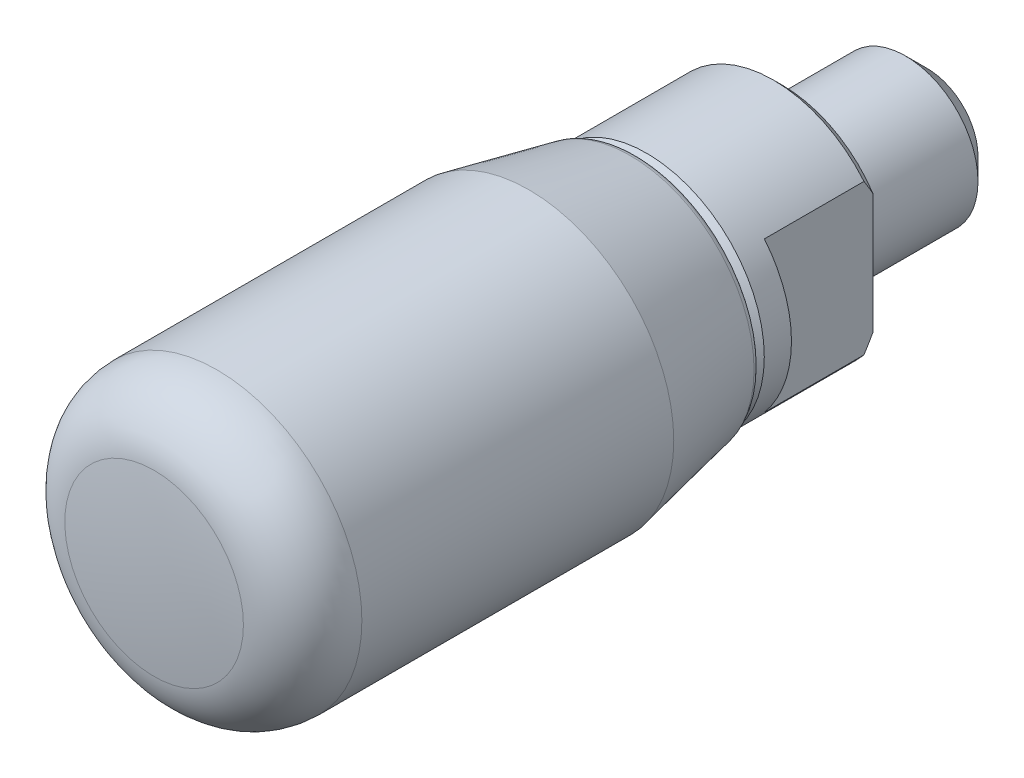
ISO-10303-21;
HEADER;
FILE_DESCRIPTION(('STEP AP214'),'2;1');
FILE_NAME('part.step','',(''),(''),'','','');
FILE_SCHEMA(('AUTOMOTIVE_DESIGN { 1 0 10303 214 1 1 1 1 }'));
ENDSEC;
DATA;
#1=APPLICATION_CONTEXT('core data for automotive mechanical design processes');
#2=APPLICATION_PROTOCOL_DEFINITION('international standard','automotive_design',2000,#1);
#3=PRODUCT_CONTEXT('',#1,'mechanical');
#4=PRODUCT('Part','Part','',(#3));
#5=PRODUCT_RELATED_PRODUCT_CATEGORY('part','',(#4));
#6=PRODUCT_DEFINITION_FORMATION('','',#4);
#7=PRODUCT_DEFINITION_CONTEXT('part definition',#1,'design');
#8=PRODUCT_DEFINITION('design','',#6,#7);
#9=PRODUCT_DEFINITION_SHAPE('','',#8);
#10=(LENGTH_UNIT() NAMED_UNIT(*) SI_UNIT(.MILLI.,.METRE.));
#11=(NAMED_UNIT(*) PLANE_ANGLE_UNIT() SI_UNIT($,.RADIAN.));
#12=(NAMED_UNIT(*) SI_UNIT($,.STERADIAN.) SOLID_ANGLE_UNIT());
#13=UNCERTAINTY_MEASURE_WITH_UNIT(LENGTH_MEASURE(1.E-05),#10,'distance_accuracy_value','');
#14=(GEOMETRIC_REPRESENTATION_CONTEXT(3) GLOBAL_UNCERTAINTY_ASSIGNED_CONTEXT((#13)) GLOBAL_UNIT_ASSIGNED_CONTEXT((#10,
#11,#12)) REPRESENTATION_CONTEXT('',''));
#15=CARTESIAN_POINT('',(0.,0.,0.));
#16=DIRECTION('',(0.,0.,1.));
#17=DIRECTION('',(1.,0.,0.));
#18=AXIS2_PLACEMENT_3D('',#15,#16,#17);
#19=CARTESIAN_POINT('',(0.,6.,0.));
#20=DIRECTION('',(0.,0.,1.));
#21=DIRECTION('',(1.,0.,0.));
#22=AXIS2_PLACEMENT_3D('',#19,#20,#21);
#23=PLANE('',#22);
#24=CARTESIAN_POINT('',(0.,0.,0.));
#25=DIRECTION('',(0.,0.,1.));
#26=DIRECTION('',(1.,0.,0.));
#27=AXIS2_PLACEMENT_3D('',#24,#25,#26);
#28=CIRCLE('',#27,4.);
#29=CARTESIAN_POINT('',(4.,0.,0.));
#30=VERTEX_POINT('',#29);
#31=EDGE_CURVE('E202',#30,#30,#28,.T.);
#32=ORIENTED_EDGE('',*,*,#31,.T.);
#33=EDGE_LOOP('',(#32));
#34=FACE_BOUND('',#33,.T.);
#35=DIRECTION('',(0.,1.,0.));
#36=VECTOR('',#35,1.);
#37=CARTESIAN_POINT('',(-5.,4.15,0.));
#38=LINE('',#37,#36);
#39=CARTESIAN_POINT('',(-5.,-3.31662479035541,0.));
#40=VERTEX_POINT('',#39);
#41=CARTESIAN_POINT('',(-5.,3.31662479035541,0.));
#42=VERTEX_POINT('',#41);
#43=EDGE_CURVE('E110',#40,#42,#38,.T.);
#44=ORIENTED_EDGE('',*,*,#43,.T.);
#45=CARTESIAN_POINT('',(0.,0.,0.));
#46=DIRECTION('',(0.,0.,1.));
#47=DIRECTION('',(1.,0.,0.));
#48=AXIS2_PLACEMENT_3D('',#45,#46,#47);
#49=CIRCLE('',#48,6.);
#50=CARTESIAN_POINT('',(5.,3.31662479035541,0.));
#51=VERTEX_POINT('',#50);
#52=EDGE_CURVE('E199',#51,#42,#49,.T.);
#53=ORIENTED_EDGE('',*,*,#52,.F.);
#54=DIRECTION('',(0.,1.,0.));
#55=VECTOR('',#54,1.);
#56=CARTESIAN_POINT('',(5.,4.15,0.));
#57=LINE('',#56,#55);
#58=CARTESIAN_POINT('',(5.,-3.31662479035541,0.));
#59=VERTEX_POINT('',#58);
#60=EDGE_CURVE('E227',#59,#51,#57,.T.);
#61=ORIENTED_EDGE('',*,*,#60,.F.);
#62=EDGE_CURVE('E193',#40,#59,#49,.T.);
#63=ORIENTED_EDGE('',*,*,#62,.F.);
#64=EDGE_LOOP('',(#44,#53,#61,#63));
#65=FACE_BOUND('',#64,.T.);
#66=ADVANCED_FACE('F14',(#34,#65),#23,.F.);
#67=CARTESIAN_POINT('',(0.,0.,0.));
#68=DIRECTION('',(0.,0.,1.));
#69=DIRECTION('',(1.,0.,0.));
#70=AXIS2_PLACEMENT_3D('',#67,#68,#69);
#71=CONICAL_SURFACE('',#70,6.,0.785398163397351);
#72=CARTESIAN_POINT('',(-7.37772942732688,4.15,2.4648326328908));
#73=CARTESIAN_POINT('',(-7.18321832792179,4.15,2.29534660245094));
#74=CARTESIAN_POINT('',(-6.98794508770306,4.15,2.12672189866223));
#75=CARTESIAN_POINT('',(-6.59545015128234,4.15,1.79177759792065));
#76=CARTESIAN_POINT('',(-6.39822855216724,4.15,1.62545788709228));
#77=CARTESIAN_POINT('',(-6.00201932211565,4.15,1.29620914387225));
#78=CARTESIAN_POINT('',(-5.80303922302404,4.15,1.13327107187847));
#79=CARTESIAN_POINT('',(-5.40206848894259,4.15,0.811062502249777));
#80=CARTESIAN_POINT('',(-5.20007737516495,4.15,0.651792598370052));
#81=CARTESIAN_POINT('',(-4.7916623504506,4.15,0.337620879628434));
#82=CARTESIAN_POINT('',(-4.58522611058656,4.15,0.182735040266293));
#83=CARTESIAN_POINT('',(-4.1675783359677,4.15,-0.120331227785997));
#84=CARTESIAN_POINT('',(-3.95636892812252,4.15,-0.26851455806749));
#85=CARTESIAN_POINT('',(-3.63451470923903,4.15,-0.484035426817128));
#86=CARTESIAN_POINT('',(-3.52620615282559,4.15,-0.55486183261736));
#87=CARTESIAN_POINT('',(-3.30780423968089,4.15,-0.693687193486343));
#88=CARTESIAN_POINT('',(-3.19771109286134,4.15,-0.761686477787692));
#89=CARTESIAN_POINT('',(-2.97533317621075,4.15,-0.894403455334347));
#90=CARTESIAN_POINT('',(-2.86304543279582,4.15,-0.959116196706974));
#91=CARTESIAN_POINT('',(-2.63614165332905,4.15,-1.08442566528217));
#92=CARTESIAN_POINT('',(-2.52152468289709,4.15,-1.14502069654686));
#93=CARTESIAN_POINT('',(-2.40564219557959,4.15,-1.20316621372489));
#94=B_SPLINE_CURVE_WITH_KNOTS('',3,(#72,#73,#74,#75,#76,#77,#78,#79,#80,#81,#82,#83,#84,#85,#86,
#87,#88,#89,#90,#91,#92,#93),.UNSPECIFIED.,.F.,.F.,(4,2,2,2,2,2,2,2,2,2,4),(0.,
0.773987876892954,1.54793737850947,2.31944587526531,3.09107838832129,3.86523254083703,
4.6390482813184,5.02724568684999,5.4153977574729,5.80411829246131,6.1929979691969),.UNSPECIFIED.);
#95=CARTESIAN_POINT('',(-5.00274924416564,4.14999999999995,0.5));
#96=VERTEX_POINT('',#95);
#97=CARTESIAN_POINT('',(-5.,4.15,0.497884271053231));
#98=VERTEX_POINT('',#97);
#99=EDGE_CURVE('E105',#96,#98,#94,.T.);
#100=ORIENTED_EDGE('',*,*,#99,.F.);
#101=CARTESIAN_POINT('',(0.,0.,0.5));
#102=DIRECTION('',(0.,0.,1.));
#103=DIRECTION('',(1.,0.,0.));
#104=AXIS2_PLACEMENT_3D('',#101,#102,#103);
#105=CIRCLE('',#104,6.49999999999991);
#106=CARTESIAN_POINT('',(5.00274924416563,4.15,0.5));
#107=VERTEX_POINT('',#106);
#108=EDGE_CURVE('E189',#107,#96,#105,.T.);
#109=ORIENTED_EDGE('',*,*,#108,.F.);
#110=CARTESIAN_POINT('',(7.37772942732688,4.15,2.4648326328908));
#111=CARTESIAN_POINT('',(7.18321832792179,4.15,2.29534660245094));
#112=CARTESIAN_POINT('',(6.98794508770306,4.15,2.12672189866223));
#113=CARTESIAN_POINT('',(6.59545015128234,4.15,1.79177759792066));
#114=CARTESIAN_POINT('',(6.39822855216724,4.15,1.62545788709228));
#115=CARTESIAN_POINT('',(6.00201932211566,4.15,1.29620914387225));
#116=CARTESIAN_POINT('',(5.80303922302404,4.15,1.13327107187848));
#117=CARTESIAN_POINT('',(5.40206848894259,4.15,0.811062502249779));
#118=CARTESIAN_POINT('',(5.20007737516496,4.15,0.651792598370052));
#119=CARTESIAN_POINT('',(4.79166235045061,4.15,0.337620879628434));
#120=CARTESIAN_POINT('',(4.58522611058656,4.15,0.182735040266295));
#121=CARTESIAN_POINT('',(4.1675783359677,4.15,-0.120331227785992));
#122=CARTESIAN_POINT('',(3.95636892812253,4.15,-0.268514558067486));
#123=CARTESIAN_POINT('',(3.63451470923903,4.15,-0.484035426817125));
#124=CARTESIAN_POINT('',(3.5262061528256,4.15,-0.554861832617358));
#125=CARTESIAN_POINT('',(3.30780423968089,4.15,-0.693687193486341));
#126=CARTESIAN_POINT('',(3.19771109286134,4.15,-0.761686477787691));
#127=CARTESIAN_POINT('',(2.97533317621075,4.15,-0.894403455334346));
#128=CARTESIAN_POINT('',(2.86304543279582,4.15,-0.959116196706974));
#129=CARTESIAN_POINT('',(2.63614165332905,4.15,-1.08442566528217));
#130=CARTESIAN_POINT('',(2.52152468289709,4.15,-1.14502069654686));
#131=CARTESIAN_POINT('',(2.40564219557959,4.15,-1.20316621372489));
#132=B_SPLINE_CURVE_WITH_KNOTS('',3,(#110,#111,#112,#113,#114,#115,#116,#117,#118,#119,#120,
#121,#122,#123,#124,#125,#126,#127,#128,#129,#130,#131),.UNSPECIFIED.,.F.,.F.,(4,2,2,2,2,2,2,2,
2,2,4),(0.,0.773987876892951,1.54793737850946,2.31944587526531,3.09107838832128,
3.86523254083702,4.6390482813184,5.02724568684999,5.4153977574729,5.80411829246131,
6.1929979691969),.UNSPECIFIED.);
#133=CARTESIAN_POINT('',(5.,4.15,0.497884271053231));
#134=VERTEX_POINT('',#133);
#135=EDGE_CURVE('E235',#107,#134,#132,.T.);
#136=ORIENTED_EDGE('',*,*,#135,.T.);
#137=CARTESIAN_POINT('',(5.,-9.13922796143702,4.4175567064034));
#138=CARTESIAN_POINT('',(5.,-9.00516778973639,4.29994970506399));
#139=CARTESIAN_POINT('',(5.,-8.87081524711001,4.182676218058));
#140=CARTESIAN_POINT('',(5.,-8.60144693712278,3.94888968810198));
#141=CARTESIAN_POINT('',(5.,-8.46643116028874,3.83237665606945));
#142=CARTESIAN_POINT('',(5.,-8.06016128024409,3.48402416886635));
#143=CARTESIAN_POINT('',(5.,-7.78779910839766,3.25347203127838));
#144=CARTESIAN_POINT('',(5.,-7.23394785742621,2.79238268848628));
#145=CARTESIAN_POINT('',(5.,-6.95238454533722,2.56193448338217));
#146=CARTESIAN_POINT('',(5.,-6.38426038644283,2.10738158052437));
#147=CARTESIAN_POINT('',(5.,-6.09770077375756,1.88327535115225));
#148=CARTESIAN_POINT('',(5.,-5.66269261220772,1.55362141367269));
#149=CARTESIAN_POINT('',(5.,-5.51675073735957,1.44476576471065));
#150=CARTESIAN_POINT('',(5.,-5.22291949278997,1.22971946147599));
#151=CARTESIAN_POINT('',(5.,-5.07503019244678,1.12352871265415));
#152=CARTESIAN_POINT('',(5.,-4.77685975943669,0.914267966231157));
#153=CARTESIAN_POINT('',(5.,-4.62657663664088,0.811200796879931));
#154=CARTESIAN_POINT('',(5.,-4.32339131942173,0.609005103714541));
#155=CARTESIAN_POINT('',(5.,-4.17048932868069,0.509876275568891));
#156=CARTESIAN_POINT('',(5.,-3.86251683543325,0.31701686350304));
#157=CARTESIAN_POINT('',(5.,-3.70746366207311,0.223258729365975));
#158=CARTESIAN_POINT('',(5.,-3.39386923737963,0.0416884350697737));
#159=CARTESIAN_POINT('',(5.,-3.23532756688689,-0.0461230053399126));
#160=CARTESIAN_POINT('',(5.,-2.9145276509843,-0.214170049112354));
#161=CARTESIAN_POINT('',(5.,-2.75227483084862,-0.294415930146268));
#162=CARTESIAN_POINT('',(5.,-2.42349610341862,-0.445539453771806));
#163=CARTESIAN_POINT('',(5.,-2.25697182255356,-0.516420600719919));
#164=CARTESIAN_POINT('',(5.,-1.91542594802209,-0.648041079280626));
#165=CARTESIAN_POINT('',(5.,-1.74029673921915,-0.708505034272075));
#166=CARTESIAN_POINT('',(5.,-1.38549006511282,-0.814351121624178));
#167=CARTESIAN_POINT('',(5.,-1.20581331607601,-0.859735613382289));
#168=CARTESIAN_POINT('',(5.,-0.844187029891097,-0.932301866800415));
#169=CARTESIAN_POINT('',(5.,-0.662265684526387,-0.959621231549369));
#170=CARTESIAN_POINT('',(5.,-0.296527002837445,-0.994519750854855));
#171=CARTESIAN_POINT('',(5.,-0.112710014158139,-1.00210246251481));
#172=CARTESIAN_POINT('',(5.,0.25542297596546,-0.99687927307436));
#173=CARTESIAN_POINT('',(5.,0.439737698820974,-0.983985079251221));
#174=CARTESIAN_POINT('',(5.,0.805945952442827,-0.938727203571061));
#175=CARTESIAN_POINT('',(5.,0.987838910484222,-0.906358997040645));
#176=CARTESIAN_POINT('',(5.,1.34914197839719,-0.824197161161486));
#177=CARTESIAN_POINT('',(5.,1.5285193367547,-0.774262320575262));
#178=CARTESIAN_POINT('',(5.,1.88254992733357,-0.659972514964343));
#179=CARTESIAN_POINT('',(5.,2.05720286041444,-0.595616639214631));
#180=CARTESIAN_POINT('',(5.,2.42894177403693,-0.444234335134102));
#181=CARTESIAN_POINT('',(5.,2.62521500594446,-0.355232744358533));
#182=CARTESIAN_POINT('',(5.,3.01196152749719,-0.165317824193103));
#183=CARTESIAN_POINT('',(5.,3.20243151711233,-0.0643978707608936));
#184=CARTESIAN_POINT('',(5.,3.57861118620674,0.146721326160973));
#185=CARTESIAN_POINT('',(5.,3.76431067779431,0.256938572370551));
#186=CARTESIAN_POINT('',(5.,4.13130160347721,0.48436015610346));
#187=CARTESIAN_POINT('',(5.,4.31259387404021,0.601563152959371));
#188=CARTESIAN_POINT('',(5.,4.6725112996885,0.842101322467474));
#189=CARTESIAN_POINT('',(5.,4.85111593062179,0.965467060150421));
#190=CARTESIAN_POINT('',(5.,5.20522704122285,1.2165650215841));
#191=CARTESIAN_POINT('',(5.,5.38073340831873,1.34429740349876));
#192=CARTESIAN_POINT('',(5.,5.72894509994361,1.60310894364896));
#193=CARTESIAN_POINT('',(5.,5.90165337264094,1.73418414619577));
#194=CARTESIAN_POINT('',(5.,6.24487651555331,1.99916223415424));
#195=CARTESIAN_POINT('',(5.,6.4153914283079,2.13306506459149));
#196=CARTESIAN_POINT('',(5.,6.80406275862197,2.44261177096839));
#197=CARTESIAN_POINT('',(5.,7.02159975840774,2.61903258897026));
#198=CARTESIAN_POINT('',(5.,7.45420128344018,2.97496683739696));
#199=CARTESIAN_POINT('',(5.,7.66926526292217,3.15448092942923));
#200=CARTESIAN_POINT('',(5.,8.09444606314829,3.51352896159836));
#201=CARTESIAN_POINT('',(5.,8.30459052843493,3.69303022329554));
#202=CARTESIAN_POINT('',(5.,8.72312762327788,4.05394892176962));
#203=CARTESIAN_POINT('',(5.,8.93152071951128,4.23536581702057));
#204=CARTESIAN_POINT('',(5.,9.13922796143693,4.4175567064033));
#205=B_SPLINE_CURVE_WITH_KNOTS('',3,(#137,#138,#139,#140,#141,#142,#143,#144,#145,#146,#147,
#148,#149,#150,#151,#152,#153,#154,#155,#156,#157,#158,#159,#160,#161,#162,#163,#164,#165,#166,
#167,#168,#169,#170,#171,#172,#173,#174,#175,#176,#177,#178,#179,#180,#181,#182,#183,#184,#185,
#186,#187,#188,#189,#190,#191,#192,#193,#194,#195,#196,#197,#198,#199,#200,#201,#202,#203,#204),
.UNSPECIFIED.,.F.,.F.,(4,2,2,2,2,2,2,2,2,2,2,2,2,2,2,2,2,2,2,2,2,2,2,2,2,2,2,2,2,2,2,2,2,4),(0.,
0.535005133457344,1.07001793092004,2.14050091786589,3.23198174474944,4.32319668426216,
4.86937586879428,5.41553564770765,5.96217600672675,6.50877404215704,7.05225635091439,
7.59580432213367,8.13860292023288,8.68119782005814,9.23645905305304,9.79163336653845,
10.3425286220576,10.8933245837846,11.4465019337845,11.999807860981,12.5576672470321,
13.1155618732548,13.761555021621,14.4079089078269,15.0555444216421,15.7030560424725,
16.3541803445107,17.0053282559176,17.6557384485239,18.3061360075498,19.1463488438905,
19.9867436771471,20.8158461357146,21.6447201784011),.UNSPECIFIED.);
#206=EDGE_CURVE('E163',#51,#134,#205,.T.);
#207=ORIENTED_EDGE('',*,*,#206,.F.);
#208=ORIENTED_EDGE('',*,*,#52,.T.);
#209=CARTESIAN_POINT('',(-5.,9.13922796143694,4.4175567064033));
#210=CARTESIAN_POINT('',(-5.,9.0051677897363,4.2999497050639));
#211=CARTESIAN_POINT('',(-5.,8.87081524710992,4.18267621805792));
#212=CARTESIAN_POINT('',(-5.,8.60144693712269,3.9488896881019));
#213=CARTESIAN_POINT('',(-5.,8.46643116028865,3.83237665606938));
#214=CARTESIAN_POINT('',(-5.,8.06016128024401,3.48402416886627));
#215=CARTESIAN_POINT('',(-5.,7.78779910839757,3.2534720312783));
#216=CARTESIAN_POINT('',(-5.,7.23394785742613,2.79238268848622));
#217=CARTESIAN_POINT('',(-5.,6.95238454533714,2.5619344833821));
#218=CARTESIAN_POINT('',(-5.,6.38426038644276,2.10738158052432));
#219=CARTESIAN_POINT('',(-5.,6.09770077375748,1.8832753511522));
#220=CARTESIAN_POINT('',(-5.,5.66269261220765,1.55362141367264));
#221=CARTESIAN_POINT('',(-5.,5.51675073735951,1.4447657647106));
#222=CARTESIAN_POINT('',(-5.,5.2229194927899,1.22971946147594));
#223=CARTESIAN_POINT('',(-5.,5.07503019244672,1.1235287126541));
#224=CARTESIAN_POINT('',(-5.,4.77685975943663,0.914267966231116));
#225=CARTESIAN_POINT('',(-5.,4.62657663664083,0.811200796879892));
#226=CARTESIAN_POINT('',(-5.,4.32339131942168,0.609005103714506));
#227=CARTESIAN_POINT('',(-5.,4.17048932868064,0.509876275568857));
#228=CARTESIAN_POINT('',(-5.,3.8625168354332,0.317016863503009));
#229=CARTESIAN_POINT('',(-5.,3.70746366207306,0.223258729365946));
#230=CARTESIAN_POINT('',(-5.,3.39386923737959,0.0416884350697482));
#231=CARTESIAN_POINT('',(-5.,3.23532756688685,-0.0461230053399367));
#232=CARTESIAN_POINT('',(-5.,2.91452765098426,-0.214170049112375));
#233=CARTESIAN_POINT('',(-5.,2.75227483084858,-0.294415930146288));
#234=CARTESIAN_POINT('',(-5.,2.42349610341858,-0.445539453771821));
#235=CARTESIAN_POINT('',(-5.,2.25697182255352,-0.516420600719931));
#236=CARTESIAN_POINT('',(-5.,1.91542594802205,-0.648041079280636));
#237=CARTESIAN_POINT('',(-5.,1.74029673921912,-0.708505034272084));
#238=CARTESIAN_POINT('',(-5.,1.38549006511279,-0.814351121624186));
#239=CARTESIAN_POINT('',(-5.,1.20581331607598,-0.859735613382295));
#240=CARTESIAN_POINT('',(-5.,0.844187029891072,-0.932301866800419));
#241=CARTESIAN_POINT('',(-5.,0.662265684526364,-0.959621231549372));
#242=CARTESIAN_POINT('',(-5.,0.296527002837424,-0.994519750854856));
#243=CARTESIAN_POINT('',(-5.,0.112710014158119,-1.00210246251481));
#244=CARTESIAN_POINT('',(-5.,-0.255422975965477,-0.996879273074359));
#245=CARTESIAN_POINT('',(-5.,-0.439737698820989,-0.98398507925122));
#246=CARTESIAN_POINT('',(-5.,-0.805945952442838,-0.938727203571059));
#247=CARTESIAN_POINT('',(-5.,-0.987838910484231,-0.906358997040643));
#248=CARTESIAN_POINT('',(-5.,-1.34914197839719,-0.824197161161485));
#249=CARTESIAN_POINT('',(-5.,-1.5285193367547,-0.774262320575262));
#250=CARTESIAN_POINT('',(-5.,-1.88254992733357,-0.659972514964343));
#251=CARTESIAN_POINT('',(-5.,-2.05720286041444,-0.59561663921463));
#252=CARTESIAN_POINT('',(-5.,-2.42894177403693,-0.444234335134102));
#253=CARTESIAN_POINT('',(-5.,-2.62521500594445,-0.355232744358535));
#254=CARTESIAN_POINT('',(-5.,-3.01196152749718,-0.165317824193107));
#255=CARTESIAN_POINT('',(-5.,-3.20243151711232,-0.0643978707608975));
#256=CARTESIAN_POINT('',(-5.,-3.57861118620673,0.146721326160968));
#257=CARTESIAN_POINT('',(-5.,-3.7643106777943,0.256938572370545));
#258=CARTESIAN_POINT('',(-5.,-4.1313016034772,0.484360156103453));
#259=CARTESIAN_POINT('',(-5.,-4.3125938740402,0.601563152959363));
#260=CARTESIAN_POINT('',(-5.,-4.67251129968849,0.842101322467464));
#261=CARTESIAN_POINT('',(-5.,-4.85111593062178,0.965467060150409));
#262=CARTESIAN_POINT('',(-5.,-5.20522704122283,1.21656502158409));
#263=CARTESIAN_POINT('',(-5.,-5.38073340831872,1.34429740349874));
#264=CARTESIAN_POINT('',(-5.,-5.72894509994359,1.60310894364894));
#265=CARTESIAN_POINT('',(-5.,-5.90165337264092,1.73418414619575));
#266=CARTESIAN_POINT('',(-5.,-6.24487651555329,1.99916223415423));
#267=CARTESIAN_POINT('',(-5.,-6.41539142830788,2.13306506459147));
#268=CARTESIAN_POINT('',(-5.,-6.80406275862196,2.44261177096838));
#269=CARTESIAN_POINT('',(-5.,-7.02159975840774,2.61903258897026));
#270=CARTESIAN_POINT('',(-5.,-7.4542012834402,2.97496683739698));
#271=CARTESIAN_POINT('',(-5.,-7.6692652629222,3.15448092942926));
#272=CARTESIAN_POINT('',(-5.,-8.09444606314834,3.51352896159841));
#273=CARTESIAN_POINT('',(-5.,-8.30459052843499,3.69303022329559));
#274=CARTESIAN_POINT('',(-5.,-8.72312762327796,4.05394892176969));
#275=CARTESIAN_POINT('',(-5.,-8.93152071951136,4.23536581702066));
#276=CARTESIAN_POINT('',(-5.,-9.13922796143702,4.4175567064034));
#277=B_SPLINE_CURVE_WITH_KNOTS('',3,(#209,#210,#211,#212,#213,#214,#215,#216,#217,#218,#219,
#220,#221,#222,#223,#224,#225,#226,#227,#228,#229,#230,#231,#232,#233,#234,#235,#236,#237,#238,
#239,#240,#241,#242,#243,#244,#245,#246,#247,#248,#249,#250,#251,#252,#253,#254,#255,#256,#257,
#258,#259,#260,#261,#262,#263,#264,#265,#266,#267,#268,#269,#270,#271,#272,#273,#274,#275,#276),
.UNSPECIFIED.,.F.,.F.,(4,2,2,2,2,2,2,2,2,2,2,2,2,2,2,2,2,2,2,2,2,2,2,2,2,2,2,2,2,2,2,2,2,4),(0.,
0.535005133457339,1.07001793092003,2.14050091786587,3.23198174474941,4.32319668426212,
4.86937586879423,5.4155356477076,5.96217600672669,6.50877404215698,7.05225635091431,
7.59580432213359,8.13860292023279,8.68119782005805,9.23645905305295,9.79163336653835,
10.3425286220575,10.8933245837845,11.4465019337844,11.9998078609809,12.557667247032,
13.1155618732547,13.7615550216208,14.4079089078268,15.0555444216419,15.7030560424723,
16.3541803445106,17.0053282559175,17.6557384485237,18.3061360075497,19.1463488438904,
19.9867436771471,20.8158461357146,21.6447201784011),.UNSPECIFIED.);
#278=EDGE_CURVE('E9',#98,#42,#277,.T.);
#279=ORIENTED_EDGE('',*,*,#278,.F.);
#280=EDGE_LOOP('',(#100,#109,#136,#207,#208,#279));
#281=FACE_BOUND('',#280,.T.);
#282=ADVANCED_FACE('F139',(#281),#71,.T.);
#283=CARTESIAN_POINT('',(-2.40564219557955,-4.15000000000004,-1.20316621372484));
#284=CARTESIAN_POINT('',(-2.52152468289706,-4.15000000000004,-1.14502069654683));
#285=CARTESIAN_POINT('',(-2.63614165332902,-4.15000000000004,-1.08442566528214));
#286=CARTESIAN_POINT('',(-2.8630454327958,-4.15000000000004,-0.959116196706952));
#287=CARTESIAN_POINT('',(-2.97533317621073,-4.15000000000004,-0.894403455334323));
#288=CARTESIAN_POINT('',(-3.19771109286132,-4.15000000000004,-0.761686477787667));
#289=CARTESIAN_POINT('',(-3.30780423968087,-4.15000000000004,-0.693687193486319));
#290=CARTESIAN_POINT('',(-3.52620615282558,-4.15000000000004,-0.554861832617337));
#291=CARTESIAN_POINT('',(-3.63451470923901,-4.15000000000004,-0.484035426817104));
#292=CARTESIAN_POINT('',(-3.95636892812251,-4.15000000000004,-0.268514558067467));
#293=CARTESIAN_POINT('',(-4.16757833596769,-4.15000000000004,-0.120331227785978));
#294=CARTESIAN_POINT('',(-4.58522611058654,-4.15000000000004,0.182735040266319));
#295=CARTESIAN_POINT('',(-4.79166235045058,-4.15000000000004,0.337620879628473));
#296=CARTESIAN_POINT('',(-5.20007737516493,-4.15000000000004,0.65179259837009));
#297=CARTESIAN_POINT('',(-5.40206848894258,-4.15000000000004,0.811062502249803));
#298=CARTESIAN_POINT('',(-5.80303922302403,-4.15000000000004,1.13327107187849));
#299=CARTESIAN_POINT('',(-6.00201932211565,-4.15000000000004,1.29620914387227));
#300=CARTESIAN_POINT('',(-6.39822855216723,-4.15000000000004,1.62545788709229));
#301=CARTESIAN_POINT('',(-6.59545015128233,-4.15000000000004,1.79177759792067));
#302=CARTESIAN_POINT('',(-6.98794508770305,-4.15000000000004,2.12672189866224));
#303=CARTESIAN_POINT('',(-7.18321832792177,-4.15000000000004,2.29534660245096));
#304=CARTESIAN_POINT('',(-7.37772942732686,-4.15000000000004,2.46483263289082));
#305=B_SPLINE_CURVE_WITH_KNOTS('',3,(#283,#284,#285,#286,#287,#288,#289,#290,#291,#292,#293,
#294,#295,#296,#297,#298,#299,#300,#301,#302,#303,#304),.UNSPECIFIED.,.F.,.F.,(4,2,2,2,2,2,2,2,
2,2,4),(0.,0.388879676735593,0.777600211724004,1.16575228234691,1.55394968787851,
2.32776542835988,3.10191958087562,3.8735520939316,4.64506059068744,5.41901009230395,
6.1929979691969),.UNSPECIFIED.);
#306=CARTESIAN_POINT('',(-5.,-4.15000000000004,0.497884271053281));
#307=VERTEX_POINT('',#306);
#308=CARTESIAN_POINT('',(-5.00274924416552,-4.15,0.5));
#309=VERTEX_POINT('',#308);
#310=EDGE_CURVE('E35',#307,#309,#305,.T.);
#311=ORIENTED_EDGE('',*,*,#310,.F.);
#312=EDGE_CURVE('E18',#40,#307,#277,.T.);
#313=ORIENTED_EDGE('',*,*,#312,.F.);
#314=ORIENTED_EDGE('',*,*,#62,.T.);
#315=CARTESIAN_POINT('',(5.,-4.15000000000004,0.497884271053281));
#316=VERTEX_POINT('',#315);
#317=EDGE_CURVE('E170',#316,#59,#205,.T.);
#318=ORIENTED_EDGE('',*,*,#317,.F.);
#319=CARTESIAN_POINT('',(2.40564219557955,-4.15000000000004,-1.20316621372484));
#320=CARTESIAN_POINT('',(2.52152468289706,-4.15000000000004,-1.14502069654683));
#321=CARTESIAN_POINT('',(2.63614165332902,-4.15000000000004,-1.08442566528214));
#322=CARTESIAN_POINT('',(2.8630454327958,-4.15000000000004,-0.959116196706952));
#323=CARTESIAN_POINT('',(2.97533317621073,-4.15000000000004,-0.894403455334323));
#324=CARTESIAN_POINT('',(3.19771109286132,-4.15000000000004,-0.761686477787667));
#325=CARTESIAN_POINT('',(3.30780423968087,-4.15000000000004,-0.693687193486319));
#326=CARTESIAN_POINT('',(3.52620615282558,-4.15000000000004,-0.554861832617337));
#327=CARTESIAN_POINT('',(3.63451470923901,-4.15000000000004,-0.484035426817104));
#328=CARTESIAN_POINT('',(3.95636892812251,-4.15000000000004,-0.268514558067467));
#329=CARTESIAN_POINT('',(4.16757833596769,-4.15000000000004,-0.120331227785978));
#330=CARTESIAN_POINT('',(4.58522611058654,-4.15000000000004,0.182735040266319));
#331=CARTESIAN_POINT('',(4.79166235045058,-4.15000000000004,0.337620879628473));
#332=CARTESIAN_POINT('',(5.20007737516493,-4.15000000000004,0.65179259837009));
#333=CARTESIAN_POINT('',(5.40206848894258,-4.15000000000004,0.811062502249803));
#334=CARTESIAN_POINT('',(5.80303922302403,-4.15000000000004,1.13327107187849));
#335=CARTESIAN_POINT('',(6.00201932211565,-4.15000000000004,1.29620914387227));
#336=CARTESIAN_POINT('',(6.39822855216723,-4.15000000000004,1.62545788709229));
#337=CARTESIAN_POINT('',(6.59545015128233,-4.15000000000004,1.79177759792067));
#338=CARTESIAN_POINT('',(6.98794508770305,-4.15000000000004,2.12672189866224));
#339=CARTESIAN_POINT('',(7.18321832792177,-4.15000000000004,2.29534660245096));
#340=CARTESIAN_POINT('',(7.37772942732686,-4.15000000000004,2.46483263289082));
#341=B_SPLINE_CURVE_WITH_KNOTS('',3,(#319,#320,#321,#322,#323,#324,#325,#326,#327,#328,#329,
#330,#331,#332,#333,#334,#335,#336,#337,#338,#339,#340),.UNSPECIFIED.,.F.,.F.,(4,2,2,2,2,2,2,2,
2,2,4),(0.,0.388879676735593,0.777600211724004,1.16575228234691,1.55394968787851,
2.32776542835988,3.10191958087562,3.8735520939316,4.64506059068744,5.41901009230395,
6.1929979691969),.UNSPECIFIED.);
#342=CARTESIAN_POINT('',(5.00274924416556,-4.15000000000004,0.5));
#343=VERTEX_POINT('',#342);
#344=EDGE_CURVE('E185',#316,#343,#341,.T.);
#345=ORIENTED_EDGE('',*,*,#344,.T.);
#346=EDGE_CURVE('E183',#309,#343,#105,.T.);
#347=ORIENTED_EDGE('',*,*,#346,.F.);
#348=EDGE_LOOP('',(#311,#313,#314,#318,#345,#347));
#349=FACE_BOUND('',#348,.T.);
#350=ADVANCED_FACE('F181',(#349),#71,.T.);
#351=CARTESIAN_POINT('',(0.,0.,40.));
#352=DIRECTION('',(0.,0.,1.));
#353=DIRECTION('',(1.,0.,0.));
#354=AXIS2_PLACEMENT_3D('',#351,#352,#353);
#355=CYLINDRICAL_SURFACE('',#354,6.5);
#356=CARTESIAN_POINT('',(0.,0.,7.5));
#357=DIRECTION('',(0.,0.,1.));
#358=DIRECTION('',(1.,0.,0.));
#359=AXIS2_PLACEMENT_3D('',#356,#357,#358);
#360=CIRCLE('',#359,6.5);
#361=CARTESIAN_POINT('',(6.5,0.,7.5));
#362=VERTEX_POINT('',#361);
#363=EDGE_CURVE('E190',#362,#362,#360,.T.);
#364=ORIENTED_EDGE('',*,*,#363,.F.);
#365=EDGE_LOOP('',(#364));
#366=FACE_BOUND('',#365,.T.);
#367=CARTESIAN_POINT('',(0.,0.,6.));
#368=DIRECTION('',(0.,0.,-1.));
#369=DIRECTION('',(0.,1.,0.));
#370=AXIS2_PLACEMENT_3D('',#367,#368,#369);
#371=CIRCLE('',#370,6.5);
#372=CARTESIAN_POINT('',(-5.00274924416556,-4.15000000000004,6.));
#373=VERTEX_POINT('',#372);
#374=CARTESIAN_POINT('',(-5.00274924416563,4.14999999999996,6.));
#375=VERTEX_POINT('',#374);
#376=EDGE_CURVE('E116',#373,#375,#371,.T.);
#377=ORIENTED_EDGE('',*,*,#376,.F.);
#378=DIRECTION('',(0.,0.,1.));
#379=VECTOR('',#378,1.);
#380=CARTESIAN_POINT('',(-5.00274924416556,-4.15000000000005,40.));
#381=LINE('',#380,#379);
#382=EDGE_CURVE('E175',#309,#373,#381,.T.);
#383=ORIENTED_EDGE('',*,*,#382,.F.);
#384=ORIENTED_EDGE('',*,*,#346,.T.);
#385=DIRECTION('',(0.,0.,1.));
#386=VECTOR('',#385,1.);
#387=CARTESIAN_POINT('',(5.00274924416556,-4.15000000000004,40.));
#388=LINE('',#387,#386);
#389=CARTESIAN_POINT('',(5.00274924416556,-4.15000000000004,6.));
#390=VERTEX_POINT('',#389);
#391=EDGE_CURVE('E171',#343,#390,#388,.T.);
#392=ORIENTED_EDGE('',*,*,#391,.T.);
#393=CARTESIAN_POINT('',(0.,0.,6.));
#394=DIRECTION('',(0.,0.,1.));
#395=DIRECTION('',(0.,-1.,0.));
#396=AXIS2_PLACEMENT_3D('',#393,#394,#395);
#397=CIRCLE('',#396,6.5);
#398=CARTESIAN_POINT('',(5.00274924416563,4.15,6.));
#399=VERTEX_POINT('',#398);
#400=EDGE_CURVE('E43',#390,#399,#397,.T.);
#401=ORIENTED_EDGE('',*,*,#400,.T.);
#402=DIRECTION('',(0.,0.,1.));
#403=VECTOR('',#402,1.);
#404=CARTESIAN_POINT('',(5.00274924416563,4.15,40.));
#405=LINE('',#404,#403);
#406=EDGE_CURVE('E211',#399,#107,#405,.F.);
#407=ORIENTED_EDGE('',*,*,#406,.T.);
#408=ORIENTED_EDGE('',*,*,#108,.T.);
#409=DIRECTION('',(0.,0.,1.));
#410=VECTOR('',#409,1.);
#411=CARTESIAN_POINT('',(-5.00274924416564,4.14999999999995,40.));
#412=LINE('',#411,#410);
#413=EDGE_CURVE('E174',#375,#96,#412,.F.);
#414=ORIENTED_EDGE('',*,*,#413,.F.);
#415=EDGE_LOOP('',(#377,#383,#384,#392,#401,#407,#408,#414));
#416=FACE_BOUND('',#415,.T.);
#417=ADVANCED_FACE('F214',(#366,#416),#355,.T.);
#418=CARTESIAN_POINT('',(0.,2.80000000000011,-8.));
#419=DIRECTION('',(0.,0.,1.));
#420=DIRECTION('',(1.,0.,0.));
#421=AXIS2_PLACEMENT_3D('',#418,#419,#420);
#422=PLANE('',#421);
#423=CARTESIAN_POINT('',(0.,0.,-8.));
#424=DIRECTION('',(0.,0.,1.));
#425=DIRECTION('',(1.,0.,0.));
#426=AXIS2_PLACEMENT_3D('',#423,#424,#425);
#427=CIRCLE('',#426,2.80000000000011);
#428=CARTESIAN_POINT('',(2.80000000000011,0.,-8.));
#429=VERTEX_POINT('',#428);
#430=EDGE_CURVE('E208',#429,#429,#427,.T.);
#431=ORIENTED_EDGE('',*,*,#430,.F.);
#432=EDGE_LOOP('',(#431));
#433=FACE_BOUND('',#432,.T.);
#434=ADVANCED_FACE('F16',(#433),#422,.F.);
#435=CARTESIAN_POINT('',(0.,0.,-8.));
#436=DIRECTION('',(0.,0.,1.));
#437=DIRECTION('',(1.,0.,0.));
#438=AXIS2_PLACEMENT_3D('',#435,#436,#437);
#439=CONICAL_SURFACE('',#438,2.80000000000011,0.785398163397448);
#440=CARTESIAN_POINT('',(0.,0.,-6.80000000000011));
#441=DIRECTION('',(0.,0.,1.));
#442=DIRECTION('',(1.,0.,0.));
#443=AXIS2_PLACEMENT_3D('',#440,#441,#442);
#444=CIRCLE('',#443,4.);
#445=CARTESIAN_POINT('',(4.,0.,-6.80000000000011));
#446=VERTEX_POINT('',#445);
#447=EDGE_CURVE('E205',#446,#446,#444,.T.);
#448=ORIENTED_EDGE('',*,*,#447,.F.);
#449=EDGE_LOOP('',(#448));
#450=FACE_BOUND('',#449,.T.);
#451=ORIENTED_EDGE('',*,*,#430,.T.);
#452=EDGE_LOOP('',(#451));
#453=FACE_BOUND('',#452,.T.);
#454=ADVANCED_FACE('F281',(#450,#453),#439,.T.);
#455=CARTESIAN_POINT('',(0.,0.,40.));
#456=DIRECTION('',(0.,0.,1.));
#457=DIRECTION('',(1.,0.,0.));
#458=AXIS2_PLACEMENT_3D('',#455,#456,#457);
#459=CYLINDRICAL_SURFACE('',#458,4.);
#460=ORIENTED_EDGE('',*,*,#31,.F.);
#461=EDGE_LOOP('',(#460));
#462=FACE_BOUND('',#461,.T.);
#463=ORIENTED_EDGE('',*,*,#447,.T.);
#464=EDGE_LOOP('',(#463));
#465=FACE_BOUND('',#464,.T.);
#466=ADVANCED_FACE('F271',(#462,#465),#459,.T.);
#467=CARTESIAN_POINT('',(0.,0.,7.5));
#468=DIRECTION('',(0.,0.,-1.));
#469=DIRECTION('',(-1.,0.,0.));
#470=AXIS2_PLACEMENT_3D('',#467,#468,#469);
#471=CONICAL_SURFACE('',#470,6.5,0.785398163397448);
#472=CARTESIAN_POINT('',(0.,0.,8.));
#473=DIRECTION('',(0.,0.,1.));
#474=DIRECTION('',(1.,0.,0.));
#475=AXIS2_PLACEMENT_3D('',#472,#473,#474);
#476=CIRCLE('',#475,6.);
#477=CARTESIAN_POINT('',(6.,0.,8.));
#478=VERTEX_POINT('',#477);
#479=EDGE_CURVE('E195',#478,#478,#476,.T.);
#480=ORIENTED_EDGE('',*,*,#479,.F.);
#481=EDGE_LOOP('',(#480));
#482=FACE_BOUND('',#481,.T.);
#483=ORIENTED_EDGE('',*,*,#363,.T.);
#484=EDGE_LOOP('',(#483));
#485=FACE_BOUND('',#484,.T.);
#486=ADVANCED_FACE('F268',(#482,#485),#471,.T.);
#487=CARTESIAN_POINT('',(0.,6.34343122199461,8.));
#488=DIRECTION('',(0.,0.,1.));
#489=DIRECTION('',(1.,0.,0.));
#490=AXIS2_PLACEMENT_3D('',#487,#488,#489);
#491=PLANE('',#490);
#492=CARTESIAN_POINT('',(0.,0.,8.));
#493=DIRECTION('',(0.,0.,1.));
#494=DIRECTION('',(1.,0.,0.));
#495=AXIS2_PLACEMENT_3D('',#492,#493,#494);
#496=CIRCLE('',#495,6.34343122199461);
#497=CARTESIAN_POINT('',(6.34343122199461,0.,8.));
#498=VERTEX_POINT('',#497);
#499=EDGE_CURVE('E460',#498,#498,#496,.T.);
#500=ORIENTED_EDGE('',*,*,#499,.F.);
#501=EDGE_LOOP('',(#500));
#502=FACE_BOUND('',#501,.T.);
#503=ORIENTED_EDGE('',*,*,#479,.T.);
#504=EDGE_LOOP('',(#503));
#505=FACE_BOUND('',#504,.T.);
#506=ADVANCED_FACE('F264',(#502,#505),#491,.F.);
#507=CARTESIAN_POINT('',(0.,0.,8.5));
#508=DIRECTION('',(0.,0.,1.));
#509=DIRECTION('',(1.,0.,0.));
#510=AXIS2_PLACEMENT_3D('',#507,#508,#509);
#511=TOROIDAL_SURFACE('',#510,6.34343122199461,0.5);
#512=CARTESIAN_POINT('',(0.,0.,8.398022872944));
#513=DIRECTION('',(0.,0.,1.));
#514=DIRECTION('',(1.,0.,0.));
#515=AXIS2_PLACEMENT_3D('',#512,#513,#514);
#516=CIRCLE('',#515,6.83292143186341);
#517=CARTESIAN_POINT('',(6.83292143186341,0.,8.398022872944));
#518=VERTEX_POINT('',#517);
#519=EDGE_CURVE('E457',#518,#518,#516,.T.);
#520=ORIENTED_EDGE('',*,*,#519,.F.);
#521=EDGE_LOOP('',(#520));
#522=FACE_BOUND('',#521,.T.);
#523=ORIENTED_EDGE('',*,*,#499,.T.);
#524=EDGE_LOOP('',(#523));
#525=FACE_BOUND('',#524,.T.);
#526=ADVANCED_FACE('F260',(#522,#525),#511,.T.);
#527=CARTESIAN_POINT('',(0.,0.,8.398022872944));
#528=DIRECTION('',(0.,0.,1.));
#529=DIRECTION('',(1.,0.,0.));
#530=AXIS2_PLACEMENT_3D('',#527,#528,#529);
#531=CONICAL_SURFACE('',#530,6.83292143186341,0.205395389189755);
#532=CARTESIAN_POINT('',(0.,0.,14.));
#533=DIRECTION('',(0.,0.,1.));
#534=DIRECTION('',(1.,0.,0.));
#535=AXIS2_PLACEMENT_3D('',#532,#533,#534);
#536=CIRCLE('',#535,8.);
#537=CARTESIAN_POINT('',(8.,0.,14.));
#538=VERTEX_POINT('',#537);
#539=EDGE_CURVE('E452',#538,#538,#536,.T.);
#540=ORIENTED_EDGE('',*,*,#539,.F.);
#541=EDGE_LOOP('',(#540));
#542=FACE_BOUND('',#541,.T.);
#543=ORIENTED_EDGE('',*,*,#519,.T.);
#544=EDGE_LOOP('',(#543));
#545=FACE_BOUND('',#544,.T.);
#546=ADVANCED_FACE('F256',(#542,#545),#531,.T.);
#547=CARTESIAN_POINT('',(0.,0.,40.));
#548=DIRECTION('',(0.,0.,1.));
#549=DIRECTION('',(1.,0.,0.));
#550=AXIS2_PLACEMENT_3D('',#547,#548,#549);
#551=CYLINDRICAL_SURFACE('',#550,8.);
#552=CARTESIAN_POINT('',(0.,0.,31.2215405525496));
#553=DIRECTION('',(0.,0.,1.));
#554=DIRECTION('',(1.,0.,0.));
#555=AXIS2_PLACEMENT_3D('',#552,#553,#554);
#556=CIRCLE('',#555,8.);
#557=CARTESIAN_POINT('',(8.,0.,31.2215405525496));
#558=VERTEX_POINT('',#557);
#559=EDGE_CURVE('E449',#558,#558,#556,.T.);
#560=ORIENTED_EDGE('',*,*,#559,.F.);
#561=EDGE_LOOP('',(#560));
#562=FACE_BOUND('',#561,.T.);
#563=ORIENTED_EDGE('',*,*,#539,.T.);
#564=EDGE_LOOP('',(#563));
#565=FACE_BOUND('',#564,.T.);
#566=ADVANCED_FACE('F252',(#562,#565),#551,.T.);
#567=CARTESIAN_POINT('',(0.,0.,31.2215405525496));
#568=DIRECTION('',(0.,0.,1.));
#569=DIRECTION('',(1.,0.,0.));
#570=AXIS2_PLACEMENT_3D('',#567,#568,#569);
#571=TOROIDAL_SURFACE('',#570,4.5,3.5);
#572=CARTESIAN_POINT('',(0.,0.,34.6948389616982));
#573=DIRECTION('',(0.,0.,1.));
#574=DIRECTION('',(1.,0.,0.));
#575=AXIS2_PLACEMENT_3D('',#572,#573,#574);
#576=CIRCLE('',#575,4.93150684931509);
#577=CARTESIAN_POINT('',(4.93150684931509,0.,34.6948389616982));
#578=VERTEX_POINT('',#577);
#579=EDGE_CURVE('E447',#578,#578,#576,.T.);
#580=ORIENTED_EDGE('',*,*,#579,.F.);
#581=EDGE_LOOP('',(#580));
#582=FACE_BOUND('',#581,.T.);
#583=ORIENTED_EDGE('',*,*,#559,.T.);
#584=EDGE_LOOP('',(#583));
#585=FACE_BOUND('',#584,.T.);
#586=ADVANCED_FACE('F248',(#582,#585),#571,.T.);
#587=CARTESIAN_POINT('',(0.,0.,-5.));
#588=DIRECTION('',(0.,0.,1.));
#589=DIRECTION('',(0.,1.,0.));
#590=AXIS2_PLACEMENT_3D('',#587,#588,#589);
#591=SPHERICAL_SURFACE('',#590,40.);
#592=ORIENTED_EDGE('',*,*,#579,.T.);
#593=EDGE_LOOP('',(#592));
#594=FACE_BOUND('',#593,.T.);
#595=ADVANCED_FACE('F157',(#594),#591,.T.);
#596=CARTESIAN_POINT('',(5.,-4.15000000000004,6.));
#597=DIRECTION('',(1.,0.,0.));
#598=DIRECTION('',(0.,0.,-1.));
#599=AXIS2_PLACEMENT_3D('',#596,#597,#598);
#600=PLANE('',#599);
#601=ORIENTED_EDGE('',*,*,#317,.T.);
#602=ORIENTED_EDGE('',*,*,#60,.T.);
#603=ORIENTED_EDGE('',*,*,#206,.T.);
#604=DIRECTION('',(0.,0.,1.));
#605=VECTOR('',#604,1.);
#606=CARTESIAN_POINT('',(5.,4.15,6.));
#607=LINE('',#606,#605);
#608=CARTESIAN_POINT('',(5.,4.15,6.));
#609=VERTEX_POINT('',#608);
#610=EDGE_CURVE('E224',#134,#609,#607,.T.);
#611=ORIENTED_EDGE('',*,*,#610,.T.);
#612=DIRECTION('',(0.,-1.,0.));
#613=VECTOR('',#612,1.);
#614=CARTESIAN_POINT('',(5.,4.15,6.));
#615=LINE('',#614,#613);
#616=CARTESIAN_POINT('',(5.,-4.15000000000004,6.));
#617=VERTEX_POINT('',#616);
#618=EDGE_CURVE('E440',#609,#617,#615,.T.);
#619=ORIENTED_EDGE('',*,*,#618,.T.);
#620=DIRECTION('',(0.,0.,-1.));
#621=VECTOR('',#620,1.);
#622=CARTESIAN_POINT('',(5.,-4.15000000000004,6.));
#623=LINE('',#622,#621);
#624=EDGE_CURVE('E220',#617,#316,#623,.T.);
#625=ORIENTED_EDGE('',*,*,#624,.T.);
#626=EDGE_LOOP('',(#601,#602,#603,#611,#619,#625));
#627=FACE_BOUND('',#626,.T.);
#628=ADVANCED_FACE('F152',(#627),#600,.T.);
#629=CARTESIAN_POINT('',(5.,4.15,6.));
#630=DIRECTION('',(0.,0.,1.));
#631=DIRECTION('',(0.,-1.,0.));
#632=AXIS2_PLACEMENT_3D('',#629,#630,#631);
#633=PLANE('',#632);
#634=DIRECTION('',(1.,0.,0.));
#635=VECTOR('',#634,1.);
#636=CARTESIAN_POINT('',(5.,-4.15000000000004,6.));
#637=LINE('',#636,#635);
#638=EDGE_CURVE('E219',#617,#390,#637,.T.);
#639=ORIENTED_EDGE('',*,*,#638,.F.);
#640=ORIENTED_EDGE('',*,*,#618,.F.);
#641=DIRECTION('',(1.,0.,0.));
#642=VECTOR('',#641,1.);
#643=CARTESIAN_POINT('',(5.,4.15,6.));
#644=LINE('',#643,#642);
#645=EDGE_CURVE('E223',#609,#399,#644,.T.);
#646=ORIENTED_EDGE('',*,*,#645,.T.);
#647=ORIENTED_EDGE('',*,*,#400,.F.);
#648=EDGE_LOOP('',(#639,#640,#646,#647));
#649=FACE_BOUND('',#648,.T.);
#650=ADVANCED_FACE('F156',(#649),#633,.F.);
#651=CARTESIAN_POINT('',(5.,4.15,6.));
#652=DIRECTION('',(0.,1.,0.));
#653=DIRECTION('',(1.,0.,0.));
#654=AXIS2_PLACEMENT_3D('',#651,#652,#653);
#655=PLANE('',#654);
#656=ORIENTED_EDGE('',*,*,#406,.F.);
#657=ORIENTED_EDGE('',*,*,#645,.F.);
#658=ORIENTED_EDGE('',*,*,#610,.F.);
#659=ORIENTED_EDGE('',*,*,#135,.F.);
#660=EDGE_LOOP('',(#656,#657,#658,#659));
#661=FACE_BOUND('',#660,.T.);
#662=ADVANCED_FACE('F159',(#661),#655,.F.);
#663=CARTESIAN_POINT('',(5.,-4.15000000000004,6.));
#664=DIRECTION('',(0.,-1.,0.));
#665=DIRECTION('',(-1.,0.,0.));
#666=AXIS2_PLACEMENT_3D('',#663,#664,#665);
#667=PLANE('',#666);
#668=ORIENTED_EDGE('',*,*,#624,.F.);
#669=ORIENTED_EDGE('',*,*,#638,.T.);
#670=ORIENTED_EDGE('',*,*,#391,.F.);
#671=ORIENTED_EDGE('',*,*,#344,.F.);
#672=EDGE_LOOP('',(#668,#669,#670,#671));
#673=FACE_BOUND('',#672,.T.);
#674=ADVANCED_FACE('F217',(#673),#667,.F.);
#675=CARTESIAN_POINT('',(-5.,-4.15000000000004,0.));
#676=DIRECTION('',(-1.,0.,0.));
#677=DIRECTION('',(0.,0.,1.));
#678=AXIS2_PLACEMENT_3D('',#675,#676,#677);
#679=PLANE('',#678);
#680=ORIENTED_EDGE('',*,*,#278,.T.);
#681=ORIENTED_EDGE('',*,*,#43,.F.);
#682=ORIENTED_EDGE('',*,*,#312,.T.);
#683=DIRECTION('',(0.,0.,-1.));
#684=VECTOR('',#683,1.);
#685=CARTESIAN_POINT('',(-5.,-4.15000000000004,0.));
#686=LINE('',#685,#684);
#687=CARTESIAN_POINT('',(-5.,-4.15000000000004,6.));
#688=VERTEX_POINT('',#687);
#689=EDGE_CURVE('E121',#688,#307,#686,.T.);
#690=ORIENTED_EDGE('',*,*,#689,.F.);
#691=DIRECTION('',(0.,-1.,0.));
#692=VECTOR('',#691,1.);
#693=CARTESIAN_POINT('',(-5.,4.14999999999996,6.));
#694=LINE('',#693,#692);
#695=CARTESIAN_POINT('',(-5.,4.14999999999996,6.));
#696=VERTEX_POINT('',#695);
#697=EDGE_CURVE('E109',#696,#688,#694,.T.);
#698=ORIENTED_EDGE('',*,*,#697,.F.);
#699=DIRECTION('',(0.,0.,1.));
#700=VECTOR('',#699,1.);
#701=CARTESIAN_POINT('',(-5.,4.15,0.));
#702=LINE('',#701,#700);
#703=EDGE_CURVE('E99',#98,#696,#702,.T.);
#704=ORIENTED_EDGE('',*,*,#703,.F.);
#705=EDGE_LOOP('',(#680,#681,#682,#690,#698,#704));
#706=FACE_BOUND('',#705,.T.);
#707=ADVANCED_FACE('F120',(#706),#679,.T.);
#708=CARTESIAN_POINT('',(-5.,4.15,0.));
#709=DIRECTION('',(0.,-1.,0.));
#710=DIRECTION('',(0.,0.,-1.));
#711=AXIS2_PLACEMENT_3D('',#708,#709,#710);
#712=PLANE('',#711);
#713=ORIENTED_EDGE('',*,*,#99,.T.);
#714=ORIENTED_EDGE('',*,*,#703,.T.);
#715=DIRECTION('',(-1.,0.,0.));
#716=VECTOR('',#715,1.);
#717=CARTESIAN_POINT('',(-5.,4.14999999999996,6.));
#718=LINE('',#717,#716);
#719=EDGE_CURVE('E102',#696,#375,#718,.T.);
#720=ORIENTED_EDGE('',*,*,#719,.T.);
#721=ORIENTED_EDGE('',*,*,#413,.T.);
#722=EDGE_LOOP('',(#713,#714,#720,#721));
#723=FACE_BOUND('',#722,.T.);
#724=ADVANCED_FACE('F101',(#723),#712,.T.);
#725=CARTESIAN_POINT('',(-5.,4.14999999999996,6.));
#726=DIRECTION('',(0.,0.,-1.));
#727=DIRECTION('',(0.,1.,0.));
#728=AXIS2_PLACEMENT_3D('',#725,#726,#727);
#729=PLANE('',#728);
#730=DIRECTION('',(-1.,0.,0.));
#731=VECTOR('',#730,1.);
#732=CARTESIAN_POINT('',(-5.,-4.15000000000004,6.));
#733=LINE('',#732,#731);
#734=EDGE_CURVE('E117',#688,#373,#733,.T.);
#735=ORIENTED_EDGE('',*,*,#734,.T.);
#736=ORIENTED_EDGE('',*,*,#376,.T.);
#737=ORIENTED_EDGE('',*,*,#719,.F.);
#738=ORIENTED_EDGE('',*,*,#697,.T.);
#739=EDGE_LOOP('',(#735,#736,#737,#738));
#740=FACE_BOUND('',#739,.T.);
#741=ADVANCED_FACE('F114',(#740),#729,.T.);
#742=CARTESIAN_POINT('',(-5.,-4.15000000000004,0.));
#743=DIRECTION('',(0.,1.,0.));
#744=DIRECTION('',(0.,0.,1.));
#745=AXIS2_PLACEMENT_3D('',#742,#743,#744);
#746=PLANE('',#745);
#747=ORIENTED_EDGE('',*,*,#310,.T.);
#748=ORIENTED_EDGE('',*,*,#382,.T.);
#749=ORIENTED_EDGE('',*,*,#734,.F.);
#750=ORIENTED_EDGE('',*,*,#689,.T.);
#751=EDGE_LOOP('',(#747,#748,#749,#750));
#752=FACE_BOUND('',#751,.T.);
#753=ADVANCED_FACE('F143',(#752),#746,.T.);
#754=CLOSED_SHELL('',(#66,#282,#350,#417,#434,#454,#466,#486,#506,#526,#546,#566,#586,#595,#628,
#650,#662,#674,#707,#724,#741,#753));
#755=MANIFOLD_SOLID_BREP('B1',#754);
#756=ADVANCED_BREP_SHAPE_REPRESENTATION('',(#18,#755),#14);
#757=SHAPE_DEFINITION_REPRESENTATION(#9,#756);
ENDSEC;
END-ISO-10303-21;
